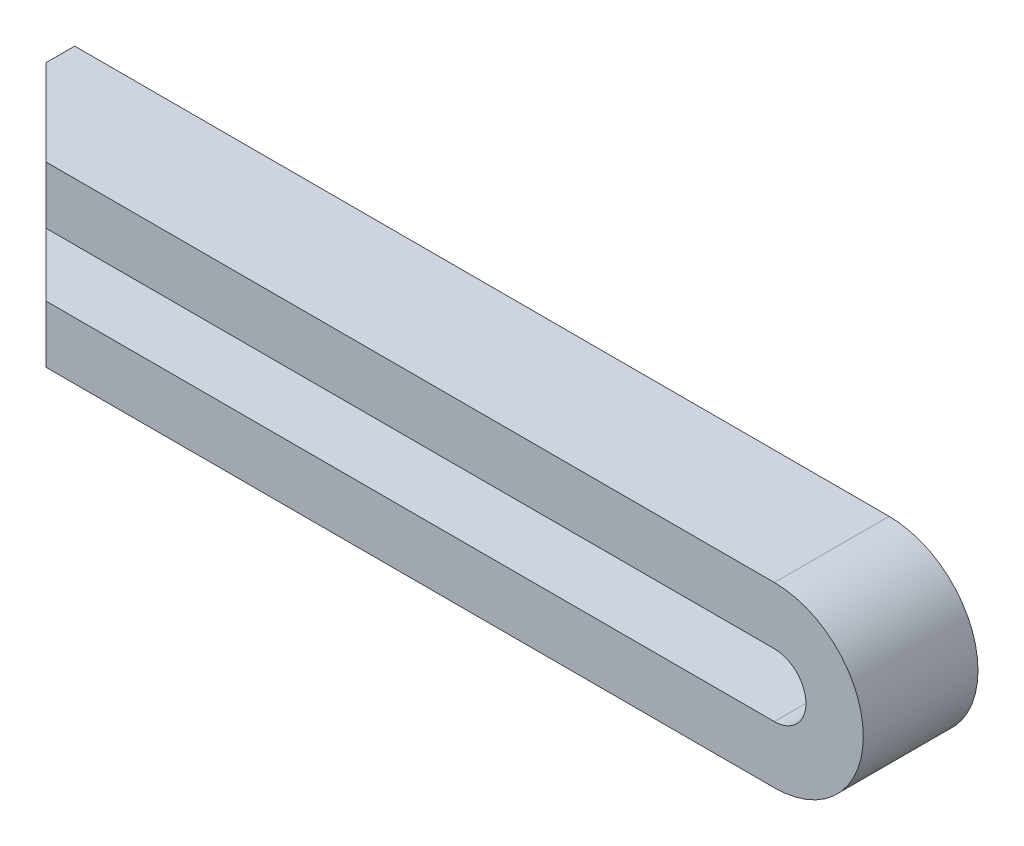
ISO-10303-21;
HEADER;
FILE_DESCRIPTION(('STEP AP214'),'2;1');
FILE_NAME('part.step','',(''),(''),'','','');
FILE_SCHEMA(('AUTOMOTIVE_DESIGN { 1 0 10303 214 1 1 1 1 }'));
ENDSEC;
DATA;
#1=APPLICATION_CONTEXT('core data for automotive mechanical design processes');
#2=APPLICATION_PROTOCOL_DEFINITION('international standard','automotive_design',2000,#1);
#3=PRODUCT_CONTEXT('',#1,'mechanical');
#4=PRODUCT('Part','Part','',(#3));
#5=PRODUCT_RELATED_PRODUCT_CATEGORY('part','',(#4));
#6=PRODUCT_DEFINITION_FORMATION('','',#4);
#7=PRODUCT_DEFINITION_CONTEXT('part definition',#1,'design');
#8=PRODUCT_DEFINITION('design','',#6,#7);
#9=PRODUCT_DEFINITION_SHAPE('','',#8);
#10=(LENGTH_UNIT() NAMED_UNIT(*) SI_UNIT(.MILLI.,.METRE.));
#11=(NAMED_UNIT(*) PLANE_ANGLE_UNIT() SI_UNIT($,.RADIAN.));
#12=(NAMED_UNIT(*) SI_UNIT($,.STERADIAN.) SOLID_ANGLE_UNIT());
#13=UNCERTAINTY_MEASURE_WITH_UNIT(LENGTH_MEASURE(1.E-05),#10,'distance_accuracy_value','');
#14=(GEOMETRIC_REPRESENTATION_CONTEXT(3) GLOBAL_UNCERTAINTY_ASSIGNED_CONTEXT((#13)) GLOBAL_UNIT_ASSIGNED_CONTEXT((#10,
#11,#12)) REPRESENTATION_CONTEXT('',''));
#15=CARTESIAN_POINT('',(0.,0.,0.));
#16=DIRECTION('',(0.,0.,1.));
#17=DIRECTION('',(1.,0.,0.));
#18=AXIS2_PLACEMENT_3D('',#15,#16,#17);
#19=CARTESIAN_POINT('',(-284.,-11.,0.));
#20=DIRECTION('',(-1.,0.,0.));
#21=DIRECTION('',(0.,-1.,0.));
#22=AXIS2_PLACEMENT_3D('',#19,#20,#21);
#23=PLANE('',#22);
#24=DIRECTION('',(0.,1.,0.));
#25=VECTOR('',#24,1.);
#26=CARTESIAN_POINT('',(-284.,0.,0.));
#27=LINE('',#26,#25);
#28=CARTESIAN_POINT('',(-284.,-31.,0.));
#29=VERTEX_POINT('',#28);
#30=CARTESIAN_POINT('',(-284.,-11.,0.));
#31=VERTEX_POINT('',#30);
#32=EDGE_CURVE('E238',#29,#31,#27,.T.);
#33=ORIENTED_EDGE('',*,*,#32,.F.);
#34=DIRECTION('',(0.,0.,1.));
#35=VECTOR('',#34,1.);
#36=CARTESIAN_POINT('',(-284.,-31.,0.));
#37=LINE('',#36,#35);
#38=CARTESIAN_POINT('',(-283.9995,-31.,9.999));
#39=VERTEX_POINT('',#38);
#40=EDGE_CURVE('E97',#39,#29,#37,.F.);
#41=ORIENTED_EDGE('',*,*,#40,.F.);
#42=DIRECTION('',(0.,-1.,0.));
#43=VECTOR('',#42,1.);
#44=CARTESIAN_POINT('',(-284.,-11.,9.998));
#45=LINE('',#44,#43);
#46=CARTESIAN_POINT('',(-283.9995,-11.,9.999));
#47=VERTEX_POINT('',#46);
#48=EDGE_CURVE('E240',#47,#39,#45,.T.);
#49=ORIENTED_EDGE('',*,*,#48,.F.);
#50=DIRECTION('',(0.,0.,1.));
#51=VECTOR('',#50,1.);
#52=CARTESIAN_POINT('',(-284.,-11.,0.));
#53=LINE('',#52,#51);
#54=EDGE_CURVE('E188',#31,#47,#53,.T.);
#55=ORIENTED_EDGE('',*,*,#54,.F.);
#56=EDGE_LOOP('',(#33,#41,#49,#55));
#57=FACE_BOUND('',#56,.T.);
#58=ADVANCED_FACE('F14',(#57),#23,.T.);
#59=CARTESIAN_POINT('',(32.8900010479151,31.,0.));
#60=DIRECTION('',(0.,0.,-1.));
#61=DIRECTION('',(0.,-1.,0.));
#62=AXIS2_PLACEMENT_3D('',#59,#60,#61);
#63=PLANE('',#62);
#64=DIRECTION('',(0.,-1.,0.));
#65=VECTOR('',#64,1.);
#66=CARTESIAN_POINT('',(-284.,21.,0.));
#67=LINE('',#66,#65);
#68=CARTESIAN_POINT('',(-284.,31.,0.));
#69=VERTEX_POINT('',#68);
#70=CARTESIAN_POINT('',(-284.,11.,0.));
#71=VERTEX_POINT('',#70);
#72=EDGE_CURVE('E220',#69,#71,#67,.T.);
#73=ORIENTED_EDGE('',*,*,#72,.F.);
#74=DIRECTION('',(-1.,0.,0.));
#75=VECTOR('',#74,1.);
#76=CARTESIAN_POINT('',(-142.,31.,0.));
#77=LINE('',#76,#75);
#78=CARTESIAN_POINT('',(0.,31.,0.));
#79=VERTEX_POINT('',#78);
#80=EDGE_CURVE('E105',#79,#69,#77,.T.);
#81=ORIENTED_EDGE('',*,*,#80,.F.);
#82=CARTESIAN_POINT('',(0.,0.,0.));
#83=DIRECTION('',(0.,0.,1.));
#84=DIRECTION('',(1.,0.,0.));
#85=AXIS2_PLACEMENT_3D('',#82,#83,#84);
#86=CIRCLE('',#85,31.);
#87=CARTESIAN_POINT('',(0.,-31.,0.));
#88=VERTEX_POINT('',#87);
#89=EDGE_CURVE('E102',#88,#79,#86,.T.);
#90=ORIENTED_EDGE('',*,*,#89,.F.);
#91=DIRECTION('',(1.,0.,0.));
#92=VECTOR('',#91,1.);
#93=CARTESIAN_POINT('',(-142.,-31.,0.));
#94=LINE('',#93,#92);
#95=EDGE_CURVE('E88',#29,#88,#94,.T.);
#96=ORIENTED_EDGE('',*,*,#95,.F.);
#97=ORIENTED_EDGE('',*,*,#32,.T.);
#98=DIRECTION('',(-1.,0.,0.));
#99=VECTOR('',#98,1.);
#100=CARTESIAN_POINT('',(-142.,-11.,0.));
#101=LINE('',#100,#99);
#102=CARTESIAN_POINT('',(0.,-11.,0.));
#103=VERTEX_POINT('',#102);
#104=EDGE_CURVE('E194',#103,#31,#101,.T.);
#105=ORIENTED_EDGE('',*,*,#104,.F.);
#106=CARTESIAN_POINT('',(0.,0.,0.));
#107=DIRECTION('',(0.,0.,1.));
#108=DIRECTION('',(0.,1.,0.));
#109=AXIS2_PLACEMENT_3D('',#106,#107,#108);
#110=CIRCLE('',#109,11.);
#111=CARTESIAN_POINT('',(0.,11.,0.));
#112=VERTEX_POINT('',#111);
#113=EDGE_CURVE('E108',#112,#103,#110,.F.);
#114=ORIENTED_EDGE('',*,*,#113,.F.);
#115=DIRECTION('',(1.,0.,0.));
#116=VECTOR('',#115,1.);
#117=CARTESIAN_POINT('',(-142.,11.,0.));
#118=LINE('',#117,#116);
#119=EDGE_CURVE('E210',#71,#112,#118,.T.);
#120=ORIENTED_EDGE('',*,*,#119,.F.);
#121=EDGE_LOOP('',(#73,#81,#90,#96,#97,#105,#114,#120));
#122=FACE_BOUND('',#121,.T.);
#123=ADVANCED_FACE('F104',(#122),#63,.T.);
#124=CARTESIAN_POINT('',(-253.998,-11.,40.));
#125=DIRECTION('',(-0.707106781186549,0.,0.707106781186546));
#126=DIRECTION('',(-0.707106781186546,0.,-0.707106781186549));
#127=AXIS2_PLACEMENT_3D('',#124,#125,#126);
#128=PLANE('',#127);
#129=CARTESIAN_POINT('',(-253.998,-31.,40.));
#130=CARTESIAN_POINT('',(-255.248041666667,-31.,38.7499583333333));
#131=CARTESIAN_POINT('',(-256.498083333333,-31.,37.4999166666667));
#132=CARTESIAN_POINT('',(-258.998166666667,-31.,34.9998333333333));
#133=CARTESIAN_POINT('',(-260.248208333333,-31.,33.7497916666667));
#134=CARTESIAN_POINT('',(-262.748291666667,-31.,31.2497083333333));
#135=CARTESIAN_POINT('',(-263.998333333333,-31.,29.9996666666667));
#136=CARTESIAN_POINT('',(-266.498416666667,-31.,27.4995833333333));
#137=CARTESIAN_POINT('',(-267.748458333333,-31.,26.2495416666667));
#138=CARTESIAN_POINT('',(-270.248541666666,-31.,23.7494583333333));
#139=CARTESIAN_POINT('',(-271.498583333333,-31.,22.4994166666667));
#140=CARTESIAN_POINT('',(-273.998666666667,-31.,19.9993333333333));
#141=CARTESIAN_POINT('',(-275.248708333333,-31.,18.7492916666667));
#142=CARTESIAN_POINT('',(-277.748791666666,-31.,16.2492083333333));
#143=CARTESIAN_POINT('',(-278.998833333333,-31.,14.9991666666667));
#144=CARTESIAN_POINT('',(-281.498916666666,-31.,12.4990833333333));
#145=CARTESIAN_POINT('',(-282.748958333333,-31.,11.2490416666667));
#146=CARTESIAN_POINT('',(-283.999,-31.,9.999));
#147=B_SPLINE_CURVE_WITH_KNOTS('',3,(#129,#130,#131,#132,#133,#134,#135,#136,#137,#138,#139,
#140,#141,#142,#143,#144,#145,#146),.UNSPECIFIED.,.F.,.F.,(4,2,2,2,2,2,2,2,4),(0.,
5.3034776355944,10.6069552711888,15.9104329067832,21.2139105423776,26.5173881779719,
31.8208658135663,37.1243434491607,42.4278210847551),.UNSPECIFIED.);
#148=CARTESIAN_POINT('',(-253.998,-31.,40.));
#149=VERTEX_POINT('',#148);
#150=EDGE_CURVE('E252',#149,#39,#147,.T.);
#151=ORIENTED_EDGE('',*,*,#150,.F.);
#152=DIRECTION('',(0.,-1.,0.));
#153=VECTOR('',#152,1.);
#154=CARTESIAN_POINT('',(-253.998,0.,40.));
#155=LINE('',#154,#153);
#156=CARTESIAN_POINT('',(-253.998,-11.,40.));
#157=VERTEX_POINT('',#156);
#158=EDGE_CURVE('E121',#157,#149,#155,.T.);
#159=ORIENTED_EDGE('',*,*,#158,.F.);
#160=CARTESIAN_POINT('',(-283.999,-11.,9.999));
#161=CARTESIAN_POINT('',(-282.748958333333,-11.,11.2490416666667));
#162=CARTESIAN_POINT('',(-281.498916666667,-11.,12.4990833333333));
#163=CARTESIAN_POINT('',(-278.998833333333,-11.,14.9991666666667));
#164=CARTESIAN_POINT('',(-277.748791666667,-11.,16.2492083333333));
#165=CARTESIAN_POINT('',(-275.248708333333,-11.,18.7492916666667));
#166=CARTESIAN_POINT('',(-273.998666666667,-11.,19.9993333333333));
#167=CARTESIAN_POINT('',(-271.498583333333,-11.,22.4994166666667));
#168=CARTESIAN_POINT('',(-270.248541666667,-11.,23.7494583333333));
#169=CARTESIAN_POINT('',(-267.748458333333,-11.,26.2495416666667));
#170=CARTESIAN_POINT('',(-266.498416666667,-11.,27.4995833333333));
#171=CARTESIAN_POINT('',(-263.998333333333,-11.,29.9996666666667));
#172=CARTESIAN_POINT('',(-262.748291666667,-11.,31.2497083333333));
#173=CARTESIAN_POINT('',(-260.248208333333,-11.,33.7497916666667));
#174=CARTESIAN_POINT('',(-258.998166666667,-11.,34.9998333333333));
#175=CARTESIAN_POINT('',(-256.498083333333,-11.,37.4999166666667));
#176=CARTESIAN_POINT('',(-255.248041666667,-11.,38.7499583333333));
#177=CARTESIAN_POINT('',(-253.998,-11.,40.));
#178=B_SPLINE_CURVE_WITH_KNOTS('',3,(#160,#161,#162,#163,#164,#165,#166,#167,#168,#169,#170,
#171,#172,#173,#174,#175,#176,#177),.UNSPECIFIED.,.F.,.F.,(4,2,2,2,2,2,2,2,4),(0.,
5.3034776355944,10.6069552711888,15.9104329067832,21.2139105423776,26.5173881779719,
31.8208658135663,37.1243434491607,42.4278210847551),.UNSPECIFIED.);
#179=EDGE_CURVE('E197',#47,#157,#178,.T.);
#180=ORIENTED_EDGE('',*,*,#179,.F.);
#181=ORIENTED_EDGE('',*,*,#48,.T.);
#182=EDGE_LOOP('',(#151,#159,#180,#181));
#183=FACE_BOUND('',#182,.T.);
#184=ADVANCED_FACE('F144',(#183),#128,.T.);
#185=CARTESIAN_POINT('',(-284.,-31.,0.));
#186=DIRECTION('',(0.,-1.,0.));
#187=DIRECTION('',(1.,0.,0.));
#188=AXIS2_PLACEMENT_3D('',#185,#186,#187);
#189=PLANE('',#188);
#190=DIRECTION('',(0.,0.,-1.));
#191=VECTOR('',#190,1.);
#192=CARTESIAN_POINT('',(0.,-31.,20.));
#193=LINE('',#192,#191);
#194=CARTESIAN_POINT('',(0.,-31.,40.));
#195=VERTEX_POINT('',#194);
#196=EDGE_CURVE('E93',#195,#88,#193,.T.);
#197=ORIENTED_EDGE('',*,*,#196,.F.);
#198=DIRECTION('',(-1.,0.,0.));
#199=VECTOR('',#198,1.);
#200=CARTESIAN_POINT('',(31.,-31.,40.));
#201=LINE('',#200,#199);
#202=EDGE_CURVE('E119',#149,#195,#201,.F.);
#203=ORIENTED_EDGE('',*,*,#202,.F.);
#204=ORIENTED_EDGE('',*,*,#150,.T.);
#205=ORIENTED_EDGE('',*,*,#40,.T.);
#206=ORIENTED_EDGE('',*,*,#95,.T.);
#207=EDGE_LOOP('',(#197,#203,#204,#205,#206));
#208=FACE_BOUND('',#207,.T.);
#209=ADVANCED_FACE('F90',(#208),#189,.T.);
#210=CARTESIAN_POINT('',(0.,0.,40.));
#211=DIRECTION('',(0.,0.,1.));
#212=DIRECTION('',(1.,0.,0.));
#213=AXIS2_PLACEMENT_3D('',#210,#211,#212);
#214=CYLINDRICAL_SURFACE('',#213,31.);
#215=ORIENTED_EDGE('',*,*,#89,.T.);
#216=DIRECTION('',(0.,0.,1.));
#217=VECTOR('',#216,1.);
#218=CARTESIAN_POINT('',(0.,31.,0.));
#219=LINE('',#218,#217);
#220=CARTESIAN_POINT('',(0.,31.,40.));
#221=VERTEX_POINT('',#220);
#222=EDGE_CURVE('E117',#221,#79,#219,.F.);
#223=ORIENTED_EDGE('',*,*,#222,.F.);
#224=CARTESIAN_POINT('',(0.,0.,40.));
#225=DIRECTION('',(0.,0.,1.));
#226=DIRECTION('',(1.,0.,0.));
#227=AXIS2_PLACEMENT_3D('',#224,#225,#226);
#228=CIRCLE('',#227,31.);
#229=EDGE_CURVE('E112',#195,#221,#228,.T.);
#230=ORIENTED_EDGE('',*,*,#229,.F.);
#231=ORIENTED_EDGE('',*,*,#196,.T.);
#232=EDGE_LOOP('',(#215,#223,#230,#231));
#233=FACE_BOUND('',#232,.T.);
#234=ADVANCED_FACE('F110',(#233),#214,.T.);
#235=CARTESIAN_POINT('',(0.,0.,0.));
#236=DIRECTION('',(0.,0.,1.));
#237=DIRECTION('',(0.,1.,0.));
#238=AXIS2_PLACEMENT_3D('',#235,#236,#237);
#239=CYLINDRICAL_SURFACE('',#238,11.);
#240=ORIENTED_EDGE('',*,*,#113,.T.);
#241=DIRECTION('',(0.,0.,1.));
#242=VECTOR('',#241,1.);
#243=CARTESIAN_POINT('',(0.,-11.,0.));
#244=LINE('',#243,#242);
#245=CARTESIAN_POINT('',(0.,-11.,40.));
#246=VERTEX_POINT('',#245);
#247=EDGE_CURVE('E200',#246,#103,#244,.F.);
#248=ORIENTED_EDGE('',*,*,#247,.F.);
#249=CARTESIAN_POINT('',(0.,0.,40.));
#250=DIRECTION('',(0.,0.,1.));
#251=DIRECTION('',(0.,1.,0.));
#252=AXIS2_PLACEMENT_3D('',#249,#250,#251);
#253=CIRCLE('',#252,11.);
#254=CARTESIAN_POINT('',(0.,11.,40.));
#255=VERTEX_POINT('',#254);
#256=EDGE_CURVE('E205',#255,#246,#253,.F.);
#257=ORIENTED_EDGE('',*,*,#256,.F.);
#258=DIRECTION('',(0.,0.,1.));
#259=VECTOR('',#258,1.);
#260=CARTESIAN_POINT('',(0.,11.,0.));
#261=LINE('',#260,#259);
#262=EDGE_CURVE('E209',#112,#255,#261,.T.);
#263=ORIENTED_EDGE('',*,*,#262,.F.);
#264=EDGE_LOOP('',(#240,#248,#257,#263));
#265=FACE_BOUND('',#264,.T.);
#266=ADVANCED_FACE('F260',(#265),#239,.F.);
#267=CARTESIAN_POINT('',(0.,-11.,0.));
#268=DIRECTION('',(0.,1.,0.));
#269=DIRECTION('',(-1.,0.,0.));
#270=AXIS2_PLACEMENT_3D('',#267,#268,#269);
#271=PLANE('',#270);
#272=ORIENTED_EDGE('',*,*,#104,.T.);
#273=ORIENTED_EDGE('',*,*,#54,.T.);
#274=ORIENTED_EDGE('',*,*,#179,.T.);
#275=DIRECTION('',(-1.,0.,0.));
#276=VECTOR('',#275,1.);
#277=CARTESIAN_POINT('',(31.,-11.,40.));
#278=LINE('',#277,#276);
#279=EDGE_CURVE('E201',#246,#157,#278,.T.);
#280=ORIENTED_EDGE('',*,*,#279,.F.);
#281=ORIENTED_EDGE('',*,*,#247,.T.);
#282=EDGE_LOOP('',(#272,#273,#274,#280,#281));
#283=FACE_BOUND('',#282,.T.);
#284=ADVANCED_FACE('F175',(#283),#271,.T.);
#285=CARTESIAN_POINT('',(0.,31.,0.));
#286=DIRECTION('',(0.,1.,0.));
#287=DIRECTION('',(-1.,0.,0.));
#288=AXIS2_PLACEMENT_3D('',#285,#286,#287);
#289=PLANE('',#288);
#290=ORIENTED_EDGE('',*,*,#80,.T.);
#291=DIRECTION('',(0.,0.,1.));
#292=VECTOR('',#291,1.);
#293=CARTESIAN_POINT('',(-284.,31.,0.));
#294=LINE('',#293,#292);
#295=CARTESIAN_POINT('',(-284.,31.,9.998));
#296=VERTEX_POINT('',#295);
#297=EDGE_CURVE('E228',#296,#69,#294,.F.);
#298=ORIENTED_EDGE('',*,*,#297,.F.);
#299=DIRECTION('',(-0.707106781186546,0.,-0.707106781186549));
#300=VECTOR('',#299,1.);
#301=CARTESIAN_POINT('',(-268.9985,31.,24.9995));
#302=LINE('',#301,#300);
#303=CARTESIAN_POINT('',(-253.998,31.,40.));
#304=VERTEX_POINT('',#303);
#305=EDGE_CURVE('E204',#304,#296,#302,.T.);
#306=ORIENTED_EDGE('',*,*,#305,.F.);
#307=DIRECTION('',(-1.,0.,0.));
#308=VECTOR('',#307,1.);
#309=CARTESIAN_POINT('',(31.,31.,40.));
#310=LINE('',#309,#308);
#311=EDGE_CURVE('E251',#221,#304,#310,.T.);
#312=ORIENTED_EDGE('',*,*,#311,.F.);
#313=ORIENTED_EDGE('',*,*,#222,.T.);
#314=EDGE_LOOP('',(#290,#298,#306,#312,#313));
#315=FACE_BOUND('',#314,.T.);
#316=ADVANCED_FACE('F171',(#315),#289,.T.);
#317=CARTESIAN_POINT('',(-284.,31.,0.));
#318=DIRECTION('',(-1.,0.,0.));
#319=DIRECTION('',(0.,-1.,0.));
#320=AXIS2_PLACEMENT_3D('',#317,#318,#319);
#321=PLANE('',#320);
#322=ORIENTED_EDGE('',*,*,#72,.T.);
#323=DIRECTION('',(0.,0.,1.));
#324=VECTOR('',#323,1.);
#325=CARTESIAN_POINT('',(-284.,11.,0.));
#326=LINE('',#325,#324);
#327=CARTESIAN_POINT('',(-284.,11.,9.998));
#328=VERTEX_POINT('',#327);
#329=EDGE_CURVE('E216',#328,#71,#326,.F.);
#330=ORIENTED_EDGE('',*,*,#329,.F.);
#331=DIRECTION('',(0.,-1.,0.));
#332=VECTOR('',#331,1.);
#333=CARTESIAN_POINT('',(-284.,31.,9.998));
#334=LINE('',#333,#332);
#335=EDGE_CURVE('E245',#296,#328,#334,.T.);
#336=ORIENTED_EDGE('',*,*,#335,.F.);
#337=ORIENTED_EDGE('',*,*,#297,.T.);
#338=EDGE_LOOP('',(#322,#330,#336,#337));
#339=FACE_BOUND('',#338,.T.);
#340=ADVANCED_FACE('F168',(#339),#321,.T.);
#341=CARTESIAN_POINT('',(-284.,11.,0.));
#342=DIRECTION('',(0.,-1.,0.));
#343=DIRECTION('',(1.,0.,0.));
#344=AXIS2_PLACEMENT_3D('',#341,#342,#343);
#345=PLANE('',#344);
#346=ORIENTED_EDGE('',*,*,#262,.T.);
#347=DIRECTION('',(-1.,0.,0.));
#348=VECTOR('',#347,1.);
#349=CARTESIAN_POINT('',(31.,11.,40.));
#350=LINE('',#349,#348);
#351=CARTESIAN_POINT('',(-253.998,11.,40.));
#352=VERTEX_POINT('',#351);
#353=EDGE_CURVE('E32',#352,#255,#350,.F.);
#354=ORIENTED_EDGE('',*,*,#353,.F.);
#355=DIRECTION('',(0.707106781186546,0.,0.707106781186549));
#356=VECTOR('',#355,1.);
#357=CARTESIAN_POINT('',(-268.9985,11.,24.9995));
#358=LINE('',#357,#356);
#359=EDGE_CURVE('E23',#328,#352,#358,.T.);
#360=ORIENTED_EDGE('',*,*,#359,.F.);
#361=ORIENTED_EDGE('',*,*,#329,.T.);
#362=ORIENTED_EDGE('',*,*,#119,.T.);
#363=EDGE_LOOP('',(#346,#354,#360,#361,#362));
#364=FACE_BOUND('',#363,.T.);
#365=ADVANCED_FACE('F161',(#364),#345,.T.);
#366=CARTESIAN_POINT('',(32.7099890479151,-31.,40.));
#367=DIRECTION('',(0.,0.,1.));
#368=DIRECTION('',(0.,1.,0.));
#369=AXIS2_PLACEMENT_3D('',#366,#367,#368);
#370=PLANE('',#369);
#371=ORIENTED_EDGE('',*,*,#256,.T.);
#372=ORIENTED_EDGE('',*,*,#279,.T.);
#373=ORIENTED_EDGE('',*,*,#158,.T.);
#374=ORIENTED_EDGE('',*,*,#202,.T.);
#375=ORIENTED_EDGE('',*,*,#229,.T.);
#376=ORIENTED_EDGE('',*,*,#311,.T.);
#377=DIRECTION('',(0.,-1.,0.));
#378=VECTOR('',#377,1.);
#379=CARTESIAN_POINT('',(-253.998,31.,40.));
#380=LINE('',#379,#378);
#381=EDGE_CURVE('E9',#352,#304,#380,.F.);
#382=ORIENTED_EDGE('',*,*,#381,.F.);
#383=ORIENTED_EDGE('',*,*,#353,.T.);
#384=EDGE_LOOP('',(#371,#372,#373,#374,#375,#376,#382,#383));
#385=FACE_BOUND('',#384,.T.);
#386=ADVANCED_FACE('F155',(#385),#370,.T.);
#387=CARTESIAN_POINT('',(-253.998,31.,40.));
#388=DIRECTION('',(-0.707106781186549,0.,0.707106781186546));
#389=DIRECTION('',(-0.707106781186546,0.,-0.707106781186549));
#390=AXIS2_PLACEMENT_3D('',#387,#388,#389);
#391=PLANE('',#390);
#392=ORIENTED_EDGE('',*,*,#359,.T.);
#393=ORIENTED_EDGE('',*,*,#381,.T.);
#394=ORIENTED_EDGE('',*,*,#305,.T.);
#395=ORIENTED_EDGE('',*,*,#335,.T.);
#396=EDGE_LOOP('',(#392,#393,#394,#395));
#397=FACE_BOUND('',#396,.T.);
#398=ADVANCED_FACE('F153',(#397),#391,.T.);
#399=CLOSED_SHELL('',(#58,#123,#184,#209,#234,#266,#284,#316,#340,#365,#386,#398));
#400=MANIFOLD_SOLID_BREP('B1',#399);
#401=ADVANCED_BREP_SHAPE_REPRESENTATION('',(#18,#400),#14);
#402=SHAPE_DEFINITION_REPRESENTATION(#9,#401);
ENDSEC;
END-ISO-10303-21;
